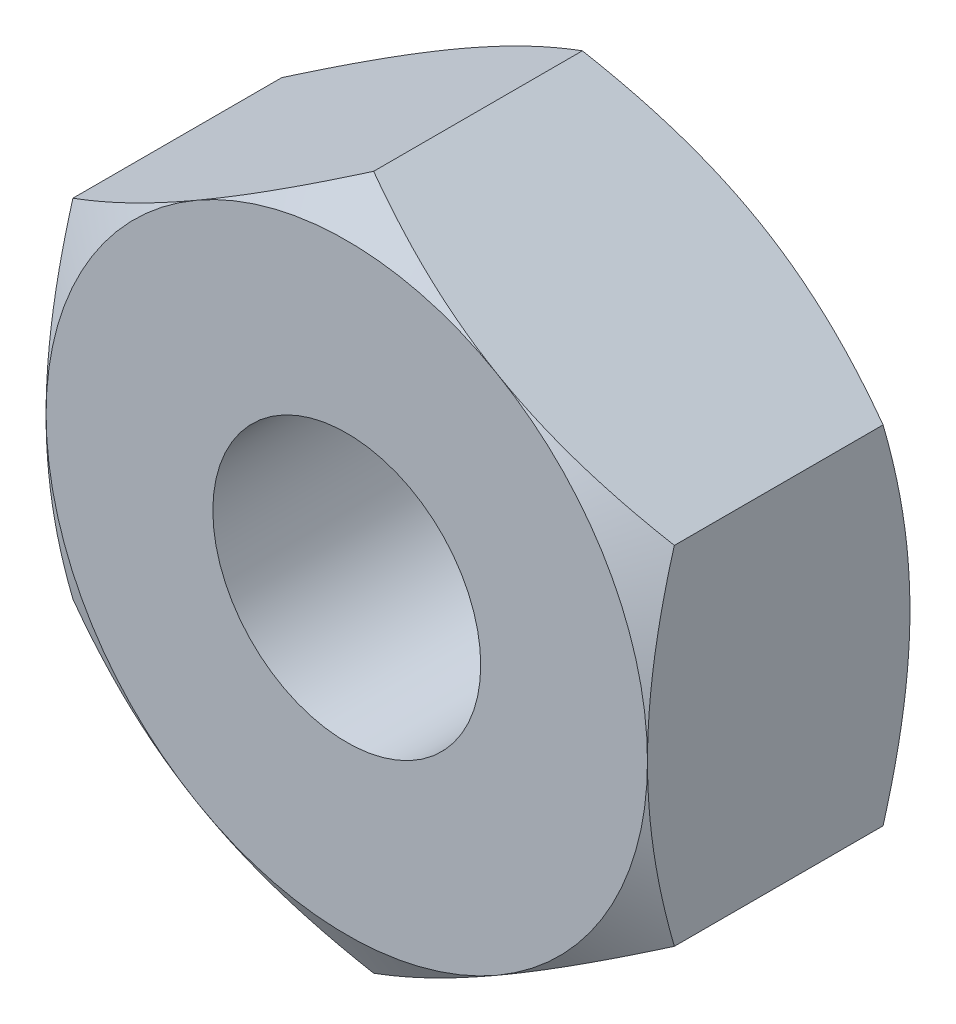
from build123d import *

# Parameters (mm, degrees)
BASE_EXTRUSION_DEPTH    = 2.4
ESQUISSE3_R             = 1.225
ENL_V_MAT_EXTRU_1_DEPTH = 5.837957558


with BuildPart() as part:
    # Esquisse1 → Base-Extrusion (new body)
    with BuildSketch(Plane.XY):
        Polygon((2.75, -1.58771324), (2.75, 1.58771324), (0, 3.175426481), (-2.75, 1.58771324), (-2.75, -1.58771324), (0, -3.175426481), align=None)
    extrude(amount=-BASE_EXTRUSION_DEPTH)

    # Esquisse2 → Enl_vement de mati_re-R_volution1 (revolve, cut)
    with BuildSketch(Plane(origin=(0, 0, 0), x_dir=(1, 0, 0), z_dir=(0, 1, 0))):
        Polygon((-2.75, 0), (-5.828460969, 0), (-5.828460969, 2.4), (-2.75, 2.4), (-4.828460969, 1.2), align=None)
    revolve(axis=Axis((0, 0, -2.4), (0, 0, 1)), mode=Mode.SUBTRACT)

    # Esquisse3 → Enl_v. mat.-Extru.1 (cut, through all)
    with BuildSketch(Plane.XY):
        Circle(ESQUISSE3_R)
    extrude(amount=-ENL_V_MAT_EXTRU_1_DEPTH, mode=Mode.SUBTRACT)


solid = part.part
